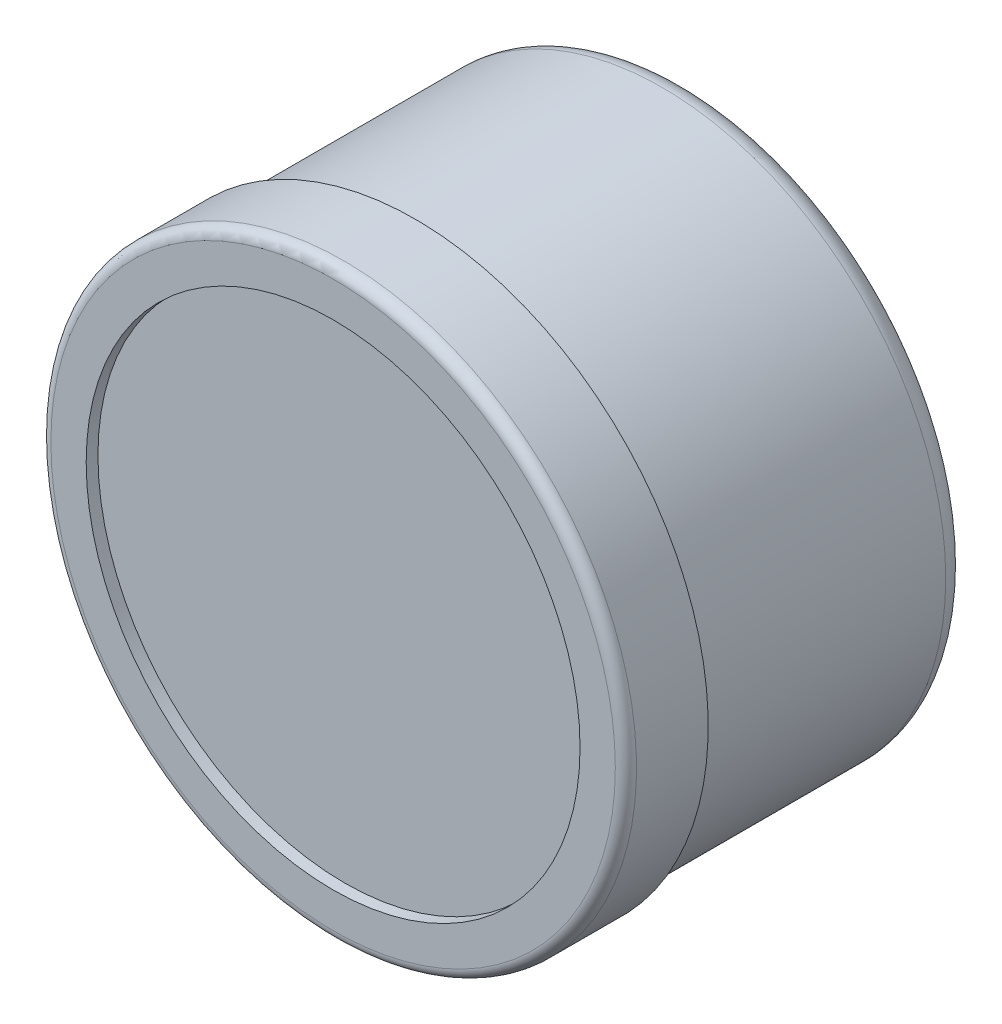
ISO-10303-21;
HEADER;
FILE_DESCRIPTION(('STEP AP214'),'2;1');
FILE_NAME('part.step','',(''),(''),'','','');
FILE_SCHEMA(('AUTOMOTIVE_DESIGN { 1 0 10303 214 1 1 1 1 }'));
ENDSEC;
DATA;
#1=APPLICATION_CONTEXT('core data for automotive mechanical design processes');
#2=APPLICATION_PROTOCOL_DEFINITION('international standard','automotive_design',2000,#1);
#3=PRODUCT_CONTEXT('',#1,'mechanical');
#4=PRODUCT('Part','Part','',(#3));
#5=PRODUCT_RELATED_PRODUCT_CATEGORY('part','',(#4));
#6=PRODUCT_DEFINITION_FORMATION('','',#4);
#7=PRODUCT_DEFINITION_CONTEXT('part definition',#1,'design');
#8=PRODUCT_DEFINITION('design','',#6,#7);
#9=PRODUCT_DEFINITION_SHAPE('','',#8);
#10=(LENGTH_UNIT() NAMED_UNIT(*) SI_UNIT(.MILLI.,.METRE.));
#11=(NAMED_UNIT(*) PLANE_ANGLE_UNIT() SI_UNIT($,.RADIAN.));
#12=(NAMED_UNIT(*) SI_UNIT($,.STERADIAN.) SOLID_ANGLE_UNIT());
#13=UNCERTAINTY_MEASURE_WITH_UNIT(LENGTH_MEASURE(1.E-05),#10,'distance_accuracy_value','');
#14=(GEOMETRIC_REPRESENTATION_CONTEXT(3) GLOBAL_UNCERTAINTY_ASSIGNED_CONTEXT((#13)) GLOBAL_UNIT_ASSIGNED_CONTEXT((#10,
#11,#12)) REPRESENTATION_CONTEXT('',''));
#15=CARTESIAN_POINT('',(0.,0.,0.));
#16=DIRECTION('',(0.,0.,1.));
#17=DIRECTION('',(1.,0.,0.));
#18=AXIS2_PLACEMENT_3D('',#15,#16,#17);
#19=CARTESIAN_POINT('',(0.,-24.1,7.));
#20=DIRECTION('',(0.,0.,-1.));
#21=DIRECTION('',(-1.,0.,0.));
#22=AXIS2_PLACEMENT_3D('',#19,#20,#21);
#23=PLANE('',#22);
#24=CARTESIAN_POINT('',(0.,0.,7.));
#25=DIRECTION('',(0.,0.,-1.));
#26=DIRECTION('',(-1.,0.,0.));
#27=AXIS2_PLACEMENT_3D('',#24,#25,#26);
#28=CIRCLE('',#27,24.);
#29=CARTESIAN_POINT('',(-24.,0.,7.));
#30=VERTEX_POINT('',#29);
#31=EDGE_CURVE('E8',#30,#30,#28,.F.);
#32=ORIENTED_EDGE('',*,*,#31,.T.);
#33=EDGE_LOOP('',(#32));
#34=FACE_BOUND('',#33,.T.);
#35=CARTESIAN_POINT('',(0.,0.,7.));
#36=DIRECTION('',(0.,0.,1.));
#37=DIRECTION('',(1.,0.,0.));
#38=AXIS2_PLACEMENT_3D('',#35,#36,#37);
#39=CIRCLE('',#38,21.);
#40=CARTESIAN_POINT('',(21.,0.,7.));
#41=VERTEX_POINT('',#40);
#42=EDGE_CURVE('E38',#41,#41,#39,.T.);
#43=ORIENTED_EDGE('',*,*,#42,.F.);
#44=EDGE_LOOP('',(#43));
#45=FACE_BOUND('',#44,.T.);
#46=ADVANCED_FACE('F12',(#34,#45),#23,.F.);
#47=CARTESIAN_POINT('',(0.,0.,6.));
#48=DIRECTION('',(0.,0.,1.));
#49=DIRECTION('',(1.,0.,0.));
#50=AXIS2_PLACEMENT_3D('',#47,#48,#49);
#51=CYLINDRICAL_SURFACE('',#50,21.);
#52=CARTESIAN_POINT('',(0.,0.,6.));
#53=DIRECTION('',(0.,0.,1.));
#54=DIRECTION('',(1.,0.,0.));
#55=AXIS2_PLACEMENT_3D('',#52,#53,#54);
#56=CIRCLE('',#55,21.);
#57=CARTESIAN_POINT('',(21.,0.,6.));
#58=VERTEX_POINT('',#57);
#59=EDGE_CURVE('E35',#58,#58,#56,.T.);
#60=ORIENTED_EDGE('',*,*,#59,.F.);
#61=EDGE_LOOP('',(#60));
#62=FACE_BOUND('',#61,.T.);
#63=ORIENTED_EDGE('',*,*,#42,.T.);
#64=EDGE_LOOP('',(#63));
#65=FACE_BOUND('',#64,.T.);
#66=ADVANCED_FACE('F69',(#62,#65),#51,.F.);
#67=CARTESIAN_POINT('',(0.,0.,6.));
#68=DIRECTION('',(0.,0.,1.));
#69=DIRECTION('',(1.,0.,0.));
#70=AXIS2_PLACEMENT_3D('',#67,#68,#69);
#71=PLANE('',#70);
#72=ORIENTED_EDGE('',*,*,#59,.T.);
#73=EDGE_LOOP('',(#72));
#74=FACE_BOUND('',#73,.T.);
#75=ADVANCED_FACE('F71',(#74),#71,.T.);
#76=CARTESIAN_POINT('',(0.,0.,-27.8169418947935));
#77=DIRECTION('',(0.,0.,-1.));
#78=DIRECTION('',(-1.,0.,0.));
#79=AXIS2_PLACEMENT_3D('',#76,#77,#78);
#80=CYLINDRICAL_SURFACE('',#79,24.9);
#81=CARTESIAN_POINT('',(0.,0.,6.1));
#82=DIRECTION('',(0.,0.,-1.));
#83=DIRECTION('',(-1.,0.,0.));
#84=AXIS2_PLACEMENT_3D('',#81,#82,#83);
#85=CIRCLE('',#84,24.9);
#86=CARTESIAN_POINT('',(-24.9,0.,6.1));
#87=VERTEX_POINT('',#86);
#88=EDGE_CURVE('E19',#87,#87,#85,.T.);
#89=ORIENTED_EDGE('',*,*,#88,.T.);
#90=EDGE_LOOP('',(#89));
#91=FACE_BOUND('',#90,.T.);
#92=CARTESIAN_POINT('',(0.,0.,0.));
#93=DIRECTION('',(0.,0.,-1.));
#94=DIRECTION('',(-1.,0.,0.));
#95=AXIS2_PLACEMENT_3D('',#92,#93,#94);
#96=CIRCLE('',#95,24.9);
#97=CARTESIAN_POINT('',(-24.9,0.,0.));
#98=VERTEX_POINT('',#97);
#99=EDGE_CURVE('E41',#98,#98,#96,.F.);
#100=ORIENTED_EDGE('',*,*,#99,.T.);
#101=EDGE_LOOP('',(#100));
#102=FACE_BOUND('',#101,.T.);
#103=ADVANCED_FACE('F45',(#91,#102),#80,.T.);
#104=CARTESIAN_POINT('',(0.,0.,-23.));
#105=DIRECTION('',(0.,0.,1.));
#106=DIRECTION('',(1.,0.,0.));
#107=AXIS2_PLACEMENT_3D('',#104,#105,#106);
#108=PLANE('',#107);
#109=CARTESIAN_POINT('',(0.,0.,-23.));
#110=DIRECTION('',(0.,0.,1.));
#111=DIRECTION('',(1.,0.,0.));
#112=AXIS2_PLACEMENT_3D('',#109,#110,#111);
#113=CIRCLE('',#112,22.1);
#114=CARTESIAN_POINT('',(22.1,0.,-23.));
#115=VERTEX_POINT('',#114);
#116=EDGE_CURVE('E27',#115,#115,#113,.F.);
#117=ORIENTED_EDGE('',*,*,#116,.T.);
#118=EDGE_LOOP('',(#117));
#119=FACE_BOUND('',#118,.T.);
#120=ADVANCED_FACE('F56',(#119),#108,.F.);
#121=CARTESIAN_POINT('',(0.,0.,-27.8169418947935));
#122=DIRECTION('',(0.,0.,-1.));
#123=DIRECTION('',(-1.,0.,0.));
#124=AXIS2_PLACEMENT_3D('',#121,#122,#123);
#125=CYLINDRICAL_SURFACE('',#124,24.1);
#126=CARTESIAN_POINT('',(0.,0.,-21.));
#127=DIRECTION('',(0.,0.,1.));
#128=DIRECTION('',(1.,0.,0.));
#129=AXIS2_PLACEMENT_3D('',#126,#127,#128);
#130=CIRCLE('',#129,24.1);
#131=CARTESIAN_POINT('',(24.1,0.,-21.));
#132=VERTEX_POINT('',#131);
#133=EDGE_CURVE('E23',#132,#132,#130,.T.);
#134=ORIENTED_EDGE('',*,*,#133,.T.);
#135=EDGE_LOOP('',(#134));
#136=FACE_BOUND('',#135,.T.);
#137=CARTESIAN_POINT('',(0.,0.,0.));
#138=DIRECTION('',(0.,0.,-1.));
#139=DIRECTION('',(-1.,0.,0.));
#140=AXIS2_PLACEMENT_3D('',#137,#138,#139);
#141=CIRCLE('',#140,24.1);
#142=CARTESIAN_POINT('',(-24.1,0.,0.));
#143=VERTEX_POINT('',#142);
#144=EDGE_CURVE('E32',#143,#143,#141,.T.);
#145=ORIENTED_EDGE('',*,*,#144,.T.);
#146=EDGE_LOOP('',(#145));
#147=FACE_BOUND('',#146,.T.);
#148=ADVANCED_FACE('F51',(#136,#147),#125,.T.);
#149=CARTESIAN_POINT('',(0.,-25.,0.));
#150=DIRECTION('',(0.,0.,-1.));
#151=DIRECTION('',(-1.,0.,0.));
#152=AXIS2_PLACEMENT_3D('',#149,#150,#151);
#153=PLANE('',#152);
#154=ORIENTED_EDGE('',*,*,#99,.F.);
#155=EDGE_LOOP('',(#154));
#156=FACE_BOUND('',#155,.T.);
#157=ORIENTED_EDGE('',*,*,#144,.F.);
#158=EDGE_LOOP('',(#157));
#159=FACE_BOUND('',#158,.T.);
#160=ADVANCED_FACE('F47',(#156,#159),#153,.T.);
#161=CARTESIAN_POINT('',(0.,0.,-21.));
#162=DIRECTION('',(0.,0.,1.));
#163=DIRECTION('',(1.,0.,0.));
#164=AXIS2_PLACEMENT_3D('',#161,#162,#163);
#165=TOROIDAL_SURFACE('',#164,22.1,2.);
#166=ORIENTED_EDGE('',*,*,#133,.F.);
#167=EDGE_LOOP('',(#166));
#168=FACE_BOUND('',#167,.T.);
#169=ORIENTED_EDGE('',*,*,#116,.F.);
#170=EDGE_LOOP('',(#169));
#171=FACE_BOUND('',#170,.T.);
#172=ADVANCED_FACE('F50',(#168,#171),#165,.T.);
#173=CARTESIAN_POINT('',(0.,0.,6.1));
#174=DIRECTION('',(0.,0.,-1.));
#175=DIRECTION('',(-1.,0.,0.));
#176=AXIS2_PLACEMENT_3D('',#173,#174,#175);
#177=TOROIDAL_SURFACE('',#176,24.,0.9);
#178=ORIENTED_EDGE('',*,*,#31,.F.);
#179=EDGE_LOOP('',(#178));
#180=FACE_BOUND('',#179,.T.);
#181=ORIENTED_EDGE('',*,*,#88,.F.);
#182=EDGE_LOOP('',(#181));
#183=FACE_BOUND('',#182,.T.);
#184=ADVANCED_FACE('F14',(#180,#183),#177,.T.);
#185=CLOSED_SHELL('',(#46,#66,#75,#103,#120,#148,#160,#172,#184));
#186=MANIFOLD_SOLID_BREP('B1',#185);
#187=ADVANCED_BREP_SHAPE_REPRESENTATION('',(#18,#186),#14);
#188=SHAPE_DEFINITION_REPRESENTATION(#9,#187);
ENDSEC;
END-ISO-10303-21;
